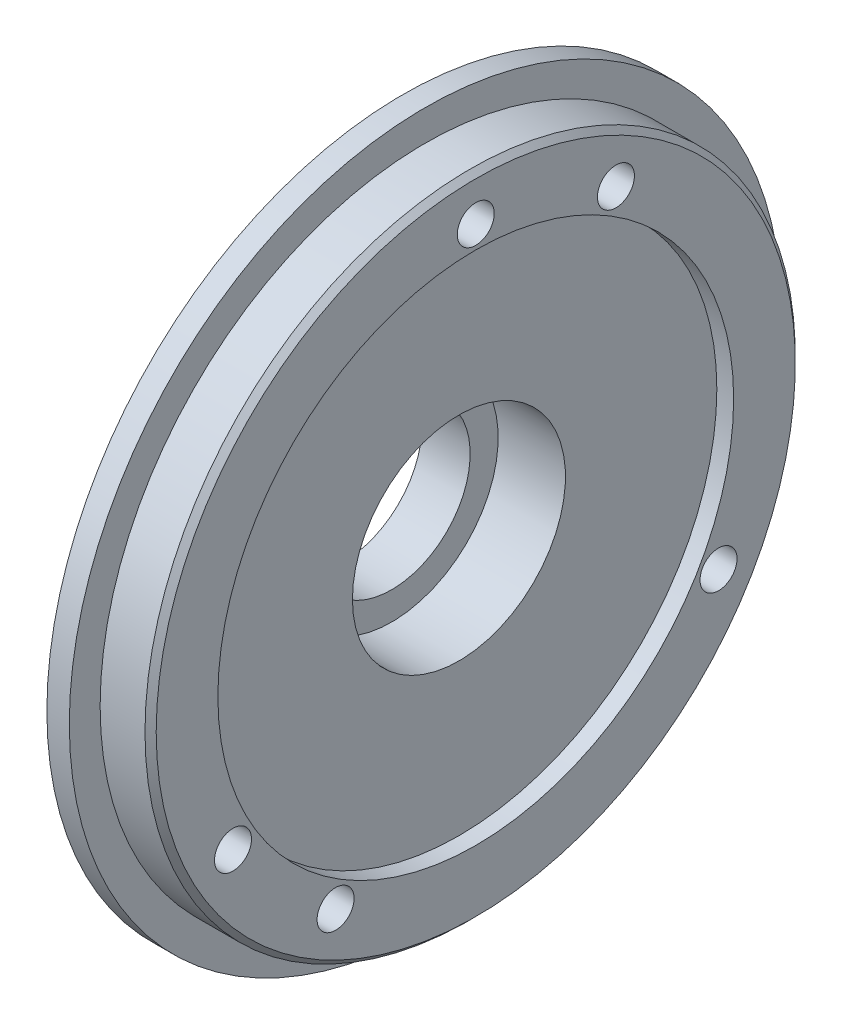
ISO-10303-21;
HEADER;
FILE_DESCRIPTION(('STEP AP214'),'2;1');
FILE_NAME('part.step','',(''),(''),'','','');
FILE_SCHEMA(('AUTOMOTIVE_DESIGN { 1 0 10303 214 1 1 1 1 }'));
ENDSEC;
DATA;
#1=APPLICATION_CONTEXT('core data for automotive mechanical design processes');
#2=APPLICATION_PROTOCOL_DEFINITION('international standard','automotive_design',2000,#1);
#3=PRODUCT_CONTEXT('',#1,'mechanical');
#4=PRODUCT('Part','Part','',(#3));
#5=PRODUCT_RELATED_PRODUCT_CATEGORY('part','',(#4));
#6=PRODUCT_DEFINITION_FORMATION('','',#4);
#7=PRODUCT_DEFINITION_CONTEXT('part definition',#1,'design');
#8=PRODUCT_DEFINITION('design','',#6,#7);
#9=PRODUCT_DEFINITION_SHAPE('','',#8);
#10=(LENGTH_UNIT() NAMED_UNIT(*) SI_UNIT(.MILLI.,.METRE.));
#11=(NAMED_UNIT(*) PLANE_ANGLE_UNIT() SI_UNIT($,.RADIAN.));
#12=(NAMED_UNIT(*) SI_UNIT($,.STERADIAN.) SOLID_ANGLE_UNIT());
#13=UNCERTAINTY_MEASURE_WITH_UNIT(LENGTH_MEASURE(1.E-05),#10,'distance_accuracy_value','');
#14=(GEOMETRIC_REPRESENTATION_CONTEXT(3) GLOBAL_UNCERTAINTY_ASSIGNED_CONTEXT((#13)) GLOBAL_UNIT_ASSIGNED_CONTEXT((#10,
#11,#12)) REPRESENTATION_CONTEXT('',''));
#15=CARTESIAN_POINT('',(0.,0.,0.));
#16=DIRECTION('',(0.,0.,1.));
#17=DIRECTION('',(1.,0.,0.));
#18=AXIS2_PLACEMENT_3D('',#15,#16,#17);
#19=CARTESIAN_POINT('',(-7.3,14.,0.));
#20=DIRECTION('',(1.,0.,0.));
#21=DIRECTION('',(0.,0.,-1.));
#22=AXIS2_PLACEMENT_3D('',#19,#20,#21);
#23=PLANE('',#22);
#24=CARTESIAN_POINT('',(-7.3,-5.49999999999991,-9.52627944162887));
#25=DIRECTION('',(-1.,0.,0.));
#26=DIRECTION('',(0.,0.,1.));
#27=AXIS2_PLACEMENT_3D('',#24,#25,#26);
#28=CIRCLE('',#27,1.025);
#29=CARTESIAN_POINT('',(-7.3,-5.49999999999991,-8.50127944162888));
#30=VERTEX_POINT('',#29);
#31=EDGE_CURVE('E61',#30,#30,#28,.T.);
#32=ORIENTED_EDGE('',*,*,#31,.F.);
#33=EDGE_LOOP('',(#32));
#34=FACE_BOUND('',#33,.T.);
#35=CARTESIAN_POINT('',(-7.3,0.,0.));
#36=DIRECTION('',(1.,0.,0.));
#37=DIRECTION('',(0.,0.,-1.));
#38=AXIS2_PLACEMENT_3D('',#35,#36,#37);
#39=CIRCLE('',#38,13.5);
#40=CARTESIAN_POINT('',(-7.3,0.,-13.5));
#41=VERTEX_POINT('',#40);
#42=EDGE_CURVE('E42',#41,#41,#39,.F.);
#43=ORIENTED_EDGE('',*,*,#42,.T.);
#44=EDGE_LOOP('',(#43));
#45=FACE_BOUND('',#44,.T.);
#46=CARTESIAN_POINT('',(-7.3,0.,0.));
#47=DIRECTION('',(-1.,0.,0.));
#48=DIRECTION('',(0.,0.,1.));
#49=AXIS2_PLACEMENT_3D('',#46,#47,#48);
#50=CIRCLE('',#49,7.);
#51=CARTESIAN_POINT('',(-7.29999999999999,0.,7.));
#52=VERTEX_POINT('',#51);
#53=EDGE_CURVE('E84',#52,#52,#50,.T.);
#54=ORIENTED_EDGE('',*,*,#53,.F.);
#55=EDGE_LOOP('',(#54));
#56=FACE_BOUND('',#55,.T.);
#57=CARTESIAN_POINT('',(-7.3,11.,0.));
#58=DIRECTION('',(-1.,0.,0.));
#59=DIRECTION('',(0.,0.,1.));
#60=AXIS2_PLACEMENT_3D('',#57,#58,#59);
#61=CIRCLE('',#60,1.025);
#62=CARTESIAN_POINT('',(-7.3,11.,1.025));
#63=VERTEX_POINT('',#62);
#64=EDGE_CURVE('E75',#63,#63,#61,.T.);
#65=ORIENTED_EDGE('',*,*,#64,.F.);
#66=EDGE_LOOP('',(#65));
#67=FACE_BOUND('',#66,.T.);
#68=CARTESIAN_POINT('',(-7.3,-5.50000000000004,9.5262794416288));
#69=DIRECTION('',(-1.,0.,0.));
#70=DIRECTION('',(0.,0.,1.));
#71=AXIS2_PLACEMENT_3D('',#68,#69,#70);
#72=CIRCLE('',#71,1.025);
#73=CARTESIAN_POINT('',(-7.3,-5.50000000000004,10.5512794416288));
#74=VERTEX_POINT('',#73);
#75=EDGE_CURVE('E69',#74,#74,#72,.T.);
#76=ORIENTED_EDGE('',*,*,#75,.F.);
#77=EDGE_LOOP('',(#76));
#78=FACE_BOUND('',#77,.T.);
#79=ADVANCED_FACE('F33',(#34,#45,#56,#67,#78),#23,.F.);
#80=CARTESIAN_POINT('',(3.,0.,0.));
#81=DIRECTION('',(-1.,0.,0.));
#82=DIRECTION('',(0.,0.,1.));
#83=AXIS2_PLACEMENT_3D('',#80,#81,#82);
#84=PLANE('',#83);
#85=CARTESIAN_POINT('',(3.,0.,0.));
#86=DIRECTION('',(-1.,0.,0.));
#87=DIRECTION('',(0.,0.,1.));
#88=AXIS2_PLACEMENT_3D('',#85,#86,#87);
#89=CIRCLE('',#88,23.);
#90=CARTESIAN_POINT('',(3.,0.,23.));
#91=VERTEX_POINT('',#90);
#92=EDGE_CURVE('E142',#91,#91,#89,.T.);
#93=ORIENTED_EDGE('',*,*,#92,.F.);
#94=EDGE_LOOP('',(#93));
#95=FACE_BOUND('',#94,.T.);
#96=CARTESIAN_POINT('',(3.,0.,0.));
#97=DIRECTION('',(-1.,0.,0.));
#98=DIRECTION('',(0.,0.,1.));
#99=AXIS2_PLACEMENT_3D('',#96,#97,#98);
#100=CIRCLE('',#99,9.5);
#101=CARTESIAN_POINT('',(3.,0.,9.5));
#102=VERTEX_POINT('',#101);
#103=EDGE_CURVE('E81',#102,#102,#100,.T.);
#104=ORIENTED_EDGE('',*,*,#103,.T.);
#105=EDGE_LOOP('',(#104));
#106=FACE_BOUND('',#105,.T.);
#107=ADVANCED_FACE('F35',(#95,#106),#84,.F.);
#108=CARTESIAN_POINT('',(4.5,0.,0.));
#109=DIRECTION('',(-1.,0.,0.));
#110=DIRECTION('',(0.,0.,1.));
#111=AXIS2_PLACEMENT_3D('',#108,#109,#110);
#112=CYLINDRICAL_SURFACE('',#111,7.);
#113=CARTESIAN_POINT('',(-3.,0.,0.));
#114=DIRECTION('',(1.,0.,0.));
#115=DIRECTION('',(0.,0.,-1.));
#116=AXIS2_PLACEMENT_3D('',#113,#114,#115);
#117=CIRCLE('',#116,7.);
#118=CARTESIAN_POINT('',(-3.,0.,7.));
#119=VERTEX_POINT('',#118);
#120=EDGE_CURVE('E37',#119,#119,#117,.F.);
#121=CARTESIAN_POINT('',(-7.29999999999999,0.,7.));
#122=CARTESIAN_POINT('',(-7.25520833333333,0.,7.));
#123=CARTESIAN_POINT('',(-7.21041666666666,0.,7.));
#124=CARTESIAN_POINT('',(-7.12083333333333,0.,7.));
#125=CARTESIAN_POINT('',(-7.07604166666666,0.,7.));
#126=CARTESIAN_POINT('',(-6.98645833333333,0.,7.));
#127=CARTESIAN_POINT('',(-6.94166666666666,0.,7.));
#128=CARTESIAN_POINT('',(-6.85208333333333,0.,7.));
#129=CARTESIAN_POINT('',(-6.80729166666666,0.,7.));
#130=CARTESIAN_POINT('',(-6.71770833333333,0.,7.));
#131=CARTESIAN_POINT('',(-6.67291666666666,0.,7.));
#132=CARTESIAN_POINT('',(-6.58333333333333,0.,7.));
#133=CARTESIAN_POINT('',(-6.53854166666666,0.,7.));
#134=CARTESIAN_POINT('',(-6.44895833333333,0.,7.));
#135=CARTESIAN_POINT('',(-6.40416666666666,0.,7.));
#136=CARTESIAN_POINT('',(-6.31458333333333,0.,7.));
#137=CARTESIAN_POINT('',(-6.26979166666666,0.,7.));
#138=CARTESIAN_POINT('',(-6.18020833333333,0.,7.));
#139=CARTESIAN_POINT('',(-6.13541666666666,0.,7.));
#140=CARTESIAN_POINT('',(-6.04583333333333,0.,7.));
#141=CARTESIAN_POINT('',(-6.00104166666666,0.,7.));
#142=CARTESIAN_POINT('',(-5.91145833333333,0.,7.));
#143=CARTESIAN_POINT('',(-5.86666666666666,0.,7.));
#144=CARTESIAN_POINT('',(-5.77708333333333,0.,7.));
#145=CARTESIAN_POINT('',(-5.73229166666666,0.,7.));
#146=CARTESIAN_POINT('',(-5.64270833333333,0.,7.));
#147=CARTESIAN_POINT('',(-5.59791666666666,0.,7.));
#148=CARTESIAN_POINT('',(-5.50833333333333,0.,7.));
#149=CARTESIAN_POINT('',(-5.46354166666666,0.,7.));
#150=CARTESIAN_POINT('',(-5.37395833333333,0.,7.));
#151=CARTESIAN_POINT('',(-5.32916666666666,0.,7.));
#152=CARTESIAN_POINT('',(-5.23958333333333,0.,7.));
#153=CARTESIAN_POINT('',(-5.19479166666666,0.,7.));
#154=CARTESIAN_POINT('',(-5.10520833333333,0.,7.));
#155=CARTESIAN_POINT('',(-5.06041666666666,0.,7.));
#156=CARTESIAN_POINT('',(-4.97083333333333,0.,7.));
#157=CARTESIAN_POINT('',(-4.92604166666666,0.,7.));
#158=CARTESIAN_POINT('',(-4.83645833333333,0.,7.));
#159=CARTESIAN_POINT('',(-4.79166666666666,0.,7.));
#160=CARTESIAN_POINT('',(-4.70208333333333,0.,7.));
#161=CARTESIAN_POINT('',(-4.65729166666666,0.,7.));
#162=CARTESIAN_POINT('',(-4.56770833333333,0.,7.));
#163=CARTESIAN_POINT('',(-4.52291666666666,0.,7.));
#164=CARTESIAN_POINT('',(-4.43333333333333,0.,7.));
#165=CARTESIAN_POINT('',(-4.38854166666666,0.,7.));
#166=CARTESIAN_POINT('',(-4.29895833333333,0.,7.));
#167=CARTESIAN_POINT('',(-4.25416666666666,0.,7.));
#168=CARTESIAN_POINT('',(-4.16458333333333,0.,7.));
#169=CARTESIAN_POINT('',(-4.11979166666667,0.,7.));
#170=CARTESIAN_POINT('',(-4.03020833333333,0.,7.));
#171=CARTESIAN_POINT('',(-3.98541666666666,0.,7.));
#172=CARTESIAN_POINT('',(-3.89583333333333,0.,7.));
#173=CARTESIAN_POINT('',(-3.85104166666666,0.,7.));
#174=CARTESIAN_POINT('',(-3.76145833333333,0.,7.));
#175=CARTESIAN_POINT('',(-3.71666666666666,0.,7.));
#176=CARTESIAN_POINT('',(-3.62708333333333,0.,7.));
#177=CARTESIAN_POINT('',(-3.58229166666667,0.,7.));
#178=CARTESIAN_POINT('',(-3.49270833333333,0.,7.));
#179=CARTESIAN_POINT('',(-3.44791666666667,0.,7.));
#180=CARTESIAN_POINT('',(-3.35833333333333,0.,7.));
#181=CARTESIAN_POINT('',(-3.31354166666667,0.,7.));
#182=CARTESIAN_POINT('',(-3.22395833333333,0.,7.));
#183=CARTESIAN_POINT('',(-3.17916666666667,0.,7.));
#184=CARTESIAN_POINT('',(-3.08958333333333,0.,7.));
#185=CARTESIAN_POINT('',(-3.04479166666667,0.,7.));
#186=CARTESIAN_POINT('',(-3.,0.,7.));
#187=B_SPLINE_CURVE_WITH_KNOTS('',3,(#121,#122,#123,#124,#125,#126,#127,#128,#129,#130,#131,
#132,#133,#134,#135,#136,#137,#138,#139,#140,#141,#142,#143,#144,#145,#146,#147,#148,#149,#150,
#151,#152,#153,#154,#155,#156,#157,#158,#159,#160,#161,#162,#163,#164,#165,#166,#167,#168,#169,
#170,#171,#172,#173,#174,#175,#176,#177,#178,#179,#180,#181,#182,#183,#184,#185,#186),
.UNSPECIFIED.,.F.,.F.,(4,2,2,2,2,2,2,2,2,2,2,2,2,2,2,2,2,2,2,2,2,2,2,2,2,2,2,2,2,2,2,2,4),(0.,
0.134374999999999,0.26875,0.403124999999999,0.5375,0.671874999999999,0.80625,0.940624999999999,
1.075,1.209375,1.34375,1.478125,1.6125,1.746875,1.88125,2.015625,2.15,2.284375,2.41875,2.553125,
2.6875,2.821875,2.95625,3.090625,3.225,3.359375,3.49375,3.628125,3.76249999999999,3.896875,
4.03124999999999,4.16562499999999,4.29999999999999),.UNSPECIFIED.);
#188=EDGE_CURVE('BSEAM182',#52,#119,#187,.T.);
#189=ORIENTED_EDGE('',*,*,#53,.T.);
#190=ORIENTED_EDGE('',*,*,#120,.F.);
#191=ORIENTED_EDGE('',*,*,#188,.T.);
#192=ORIENTED_EDGE('',*,*,#188,.F.);
#193=EDGE_LOOP('',(#189,#191,#190,#192));
#194=FACE_BOUND('',#193,.T.);
#195=ADVANCED_FACE('F182',(#194),#112,.F.);
#196=CARTESIAN_POINT('',(-3.5,29.,0.));
#197=DIRECTION('',(1.,0.,0.));
#198=DIRECTION('',(0.,0.,-1.));
#199=AXIS2_PLACEMENT_3D('',#196,#197,#198);
#200=PLANE('',#199);
#201=CARTESIAN_POINT('',(-3.5,21.650635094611,-12.5));
#202=DIRECTION('',(-1.,0.,0.));
#203=DIRECTION('',(0.,0.,1.));
#204=AXIS2_PLACEMENT_3D('',#201,#202,#203);
#205=CIRCLE('',#204,1.64999999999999);
#206=CARTESIAN_POINT('',(-3.5,21.650635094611,-10.85));
#207=VERTEX_POINT('',#206);
#208=EDGE_CURVE('E96',#207,#207,#205,.T.);
#209=ORIENTED_EDGE('',*,*,#208,.F.);
#210=EDGE_LOOP('',(#209));
#211=FACE_BOUND('',#210,.T.);
#212=CARTESIAN_POINT('',(-3.5,-12.4999999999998,-21.6506350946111));
#213=DIRECTION('',(-1.,0.,0.));
#214=DIRECTION('',(0.,0.,1.));
#215=AXIS2_PLACEMENT_3D('',#212,#213,#214);
#216=CIRCLE('',#215,1.65);
#217=CARTESIAN_POINT('',(-3.5,-12.4999999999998,-20.0006350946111));
#218=VERTEX_POINT('',#217);
#219=EDGE_CURVE('E99',#218,#218,#216,.T.);
#220=ORIENTED_EDGE('',*,*,#219,.F.);
#221=EDGE_LOOP('',(#220));
#222=FACE_BOUND('',#221,.T.);
#223=CARTESIAN_POINT('',(-3.5,0.,0.));
#224=DIRECTION('',(-1.,0.,0.));
#225=DIRECTION('',(0.,0.,1.));
#226=AXIS2_PLACEMENT_3D('',#223,#224,#225);
#227=CIRCLE('',#226,29.);
#228=CARTESIAN_POINT('',(-3.5,0.,29.));
#229=VERTEX_POINT('',#228);
#230=EDGE_CURVE('E124',#229,#229,#227,.T.);
#231=ORIENTED_EDGE('',*,*,#230,.T.);
#232=EDGE_LOOP('',(#231));
#233=FACE_BOUND('',#232,.T.);
#234=CARTESIAN_POINT('',(-3.5,0.,0.));
#235=DIRECTION('',(-1.,0.,0.));
#236=DIRECTION('',(0.,0.,1.));
#237=AXIS2_PLACEMENT_3D('',#234,#235,#236);
#238=CIRCLE('',#237,20.5);
#239=CARTESIAN_POINT('',(-3.5,0.,20.5));
#240=VERTEX_POINT('',#239);
#241=EDGE_CURVE('E121',#240,#240,#238,.T.);
#242=ORIENTED_EDGE('',*,*,#241,.F.);
#243=EDGE_LOOP('',(#242));
#244=FACE_BOUND('',#243,.T.);
#245=CARTESIAN_POINT('',(-3.5,25.,0.));
#246=DIRECTION('',(-1.,0.,0.));
#247=DIRECTION('',(0.,0.,1.));
#248=AXIS2_PLACEMENT_3D('',#245,#246,#247);
#249=CIRCLE('',#248,1.65);
#250=CARTESIAN_POINT('',(-3.5,25.,1.65));
#251=VERTEX_POINT('',#250);
#252=EDGE_CURVE('E109',#251,#251,#249,.T.);
#253=ORIENTED_EDGE('',*,*,#252,.F.);
#254=EDGE_LOOP('',(#253));
#255=FACE_BOUND('',#254,.T.);
#256=CARTESIAN_POINT('',(-3.5,-12.5000000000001,21.6506350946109));
#257=DIRECTION('',(-1.,0.,0.));
#258=DIRECTION('',(0.,0.,1.));
#259=AXIS2_PLACEMENT_3D('',#256,#257,#258);
#260=CIRCLE('',#259,1.65);
#261=CARTESIAN_POINT('',(-3.5,-12.5000000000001,23.3006350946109));
#262=VERTEX_POINT('',#261);
#263=EDGE_CURVE('E103',#262,#262,#260,.T.);
#264=ORIENTED_EDGE('',*,*,#263,.F.);
#265=EDGE_LOOP('',(#264));
#266=FACE_BOUND('',#265,.T.);
#267=CARTESIAN_POINT('',(-3.5,-21.650635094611,12.4999999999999));
#268=DIRECTION('',(-1.,0.,0.));
#269=DIRECTION('',(0.,0.,1.));
#270=AXIS2_PLACEMENT_3D('',#267,#268,#269);
#271=CIRCLE('',#270,1.64999999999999);
#272=CARTESIAN_POINT('',(-3.5,-21.650635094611,14.1499999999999));
#273=VERTEX_POINT('',#272);
#274=EDGE_CURVE('E90',#273,#273,#271,.T.);
#275=ORIENTED_EDGE('',*,*,#274,.F.);
#276=EDGE_LOOP('',(#275));
#277=FACE_BOUND('',#276,.T.);
#278=ADVANCED_FACE('F202',(#211,#222,#233,#244,#255,#266,#277),#200,.F.);
#279=CARTESIAN_POINT('',(0.,0.,0.));
#280=DIRECTION('',(-1.,0.,0.));
#281=DIRECTION('',(0.,0.,1.));
#282=AXIS2_PLACEMENT_3D('',#279,#280,#281);
#283=CYLINDRICAL_SURFACE('',#282,23.);
#284=CARTESIAN_POINT('',(4.5,0.,0.));
#285=DIRECTION('',(-1.,0.,0.));
#286=DIRECTION('',(0.,0.,1.));
#287=AXIS2_PLACEMENT_3D('',#284,#285,#286);
#288=CIRCLE('',#287,23.);
#289=CARTESIAN_POINT('',(4.5,0.,23.));
#290=VERTEX_POINT('',#289);
#291=EDGE_CURVE('E139',#290,#290,#288,.T.);
#292=ORIENTED_EDGE('',*,*,#291,.F.);
#293=EDGE_LOOP('',(#292));
#294=FACE_BOUND('',#293,.T.);
#295=ORIENTED_EDGE('',*,*,#92,.T.);
#296=EDGE_LOOP('',(#295));
#297=FACE_BOUND('',#296,.T.);
#298=ADVANCED_FACE('F205',(#294,#297),#283,.F.);
#299=CARTESIAN_POINT('',(4.5,23.,0.));
#300=DIRECTION('',(-1.,0.,0.));
#301=DIRECTION('',(0.,0.,1.));
#302=AXIS2_PLACEMENT_3D('',#299,#300,#301);
#303=PLANE('',#302);
#304=CARTESIAN_POINT('',(4.5,0.,0.));
#305=DIRECTION('',(-1.,0.,0.));
#306=DIRECTION('',(0.,0.,1.));
#307=AXIS2_PLACEMENT_3D('',#304,#305,#306);
#308=CIRCLE('',#307,28.5);
#309=CARTESIAN_POINT('',(4.5,0.,28.5));
#310=VERTEX_POINT('',#309);
#311=EDGE_CURVE('E150',#310,#310,#308,.F.);
#312=ORIENTED_EDGE('',*,*,#311,.T.);
#313=EDGE_LOOP('',(#312));
#314=FACE_BOUND('',#313,.T.);
#315=CARTESIAN_POINT('',(4.5,-21.650635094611,12.4999999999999));
#316=DIRECTION('',(-1.,0.,0.));
#317=DIRECTION('',(0.,0.,1.));
#318=AXIS2_PLACEMENT_3D('',#315,#316,#317);
#319=CIRCLE('',#318,1.65);
#320=CARTESIAN_POINT('',(4.5,-21.650635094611,14.1499999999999));
#321=VERTEX_POINT('',#320);
#322=EDGE_CURVE('E87',#321,#321,#319,.T.);
#323=ORIENTED_EDGE('',*,*,#322,.T.);
#324=EDGE_LOOP('',(#323));
#325=FACE_BOUND('',#324,.T.);
#326=CARTESIAN_POINT('',(4.5,21.650635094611,-12.5));
#327=DIRECTION('',(-1.,0.,0.));
#328=DIRECTION('',(0.,0.,1.));
#329=AXIS2_PLACEMENT_3D('',#326,#327,#328);
#330=CIRCLE('',#329,1.65);
#331=CARTESIAN_POINT('',(4.5,21.650635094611,-10.85));
#332=VERTEX_POINT('',#331);
#333=EDGE_CURVE('E93',#332,#332,#330,.T.);
#334=ORIENTED_EDGE('',*,*,#333,.T.);
#335=EDGE_LOOP('',(#334));
#336=FACE_BOUND('',#335,.T.);
#337=CARTESIAN_POINT('',(4.5,-12.4999999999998,-21.6506350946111));
#338=DIRECTION('',(-1.,0.,0.));
#339=DIRECTION('',(0.,0.,1.));
#340=AXIS2_PLACEMENT_3D('',#337,#338,#339);
#341=CIRCLE('',#340,1.65);
#342=CARTESIAN_POINT('',(4.5,-12.4999999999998,-20.0006350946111));
#343=VERTEX_POINT('',#342);
#344=EDGE_CURVE('E102',#343,#343,#341,.T.);
#345=ORIENTED_EDGE('',*,*,#344,.T.);
#346=EDGE_LOOP('',(#345));
#347=FACE_BOUND('',#346,.T.);
#348=CARTESIAN_POINT('',(4.5,-12.5000000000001,21.6506350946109));
#349=DIRECTION('',(-1.,0.,0.));
#350=DIRECTION('',(0.,0.,1.));
#351=AXIS2_PLACEMENT_3D('',#348,#349,#350);
#352=CIRCLE('',#351,1.65);
#353=CARTESIAN_POINT('',(4.5,-12.5000000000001,23.3006350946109));
#354=VERTEX_POINT('',#353);
#355=EDGE_CURVE('E106',#354,#354,#352,.T.);
#356=ORIENTED_EDGE('',*,*,#355,.T.);
#357=EDGE_LOOP('',(#356));
#358=FACE_BOUND('',#357,.T.);
#359=CARTESIAN_POINT('',(4.5,25.,0.));
#360=DIRECTION('',(-1.,0.,0.));
#361=DIRECTION('',(0.,0.,1.));
#362=AXIS2_PLACEMENT_3D('',#359,#360,#361);
#363=CIRCLE('',#362,1.65);
#364=CARTESIAN_POINT('',(4.5,25.,1.65));
#365=VERTEX_POINT('',#364);
#366=EDGE_CURVE('E112',#365,#365,#363,.T.);
#367=ORIENTED_EDGE('',*,*,#366,.T.);
#368=EDGE_LOOP('',(#367));
#369=FACE_BOUND('',#368,.T.);
#370=ORIENTED_EDGE('',*,*,#291,.T.);
#371=EDGE_LOOP('',(#370));
#372=FACE_BOUND('',#371,.T.);
#373=ADVANCED_FACE('F225',(#314,#325,#336,#347,#358,#369,#372),#303,.F.);
#374=CARTESIAN_POINT('',(0.,0.,0.));
#375=DIRECTION('',(-1.,0.,0.));
#376=DIRECTION('',(0.,0.,1.));
#377=AXIS2_PLACEMENT_3D('',#374,#375,#376);
#378=CYLINDRICAL_SURFACE('',#377,29.);
#379=CARTESIAN_POINT('',(4.,0.,0.));
#380=DIRECTION('',(-1.,0.,0.));
#381=DIRECTION('',(0.,0.,1.));
#382=AXIS2_PLACEMENT_3D('',#379,#380,#381);
#383=CIRCLE('',#382,29.);
#384=CARTESIAN_POINT('',(4.,0.,29.));
#385=VERTEX_POINT('',#384);
#386=EDGE_CURVE('E145',#385,#385,#383,.T.);
#387=ORIENTED_EDGE('',*,*,#386,.T.);
#388=EDGE_LOOP('',(#387));
#389=FACE_BOUND('',#388,.T.);
#390=CARTESIAN_POINT('',(0.,0.,0.));
#391=DIRECTION('',(-1.,0.,0.));
#392=DIRECTION('',(0.,0.,1.));
#393=AXIS2_PLACEMENT_3D('',#390,#391,#392);
#394=CIRCLE('',#393,29.);
#395=CARTESIAN_POINT('',(0.,0.,29.));
#396=VERTEX_POINT('',#395);
#397=EDGE_CURVE('E136',#396,#396,#394,.T.);
#398=ORIENTED_EDGE('',*,*,#397,.F.);
#399=EDGE_LOOP('',(#398));
#400=FACE_BOUND('',#399,.T.);
#401=ADVANCED_FACE('F221',(#389,#400),#378,.T.);
#402=CARTESIAN_POINT('',(0.,29.,0.));
#403=DIRECTION('',(-1.,0.,0.));
#404=DIRECTION('',(0.,0.,1.));
#405=AXIS2_PLACEMENT_3D('',#402,#403,#404);
#406=PLANE('',#405);
#407=CARTESIAN_POINT('',(0.,0.,0.));
#408=DIRECTION('',(-1.,0.,0.));
#409=DIRECTION('',(0.,0.,1.));
#410=AXIS2_PLACEMENT_3D('',#407,#408,#409);
#411=CIRCLE('',#410,31.75);
#412=CARTESIAN_POINT('',(0.,0.,31.75));
#413=VERTEX_POINT('',#412);
#414=EDGE_CURVE('E133',#413,#413,#411,.T.);
#415=ORIENTED_EDGE('',*,*,#414,.F.);
#416=EDGE_LOOP('',(#415));
#417=FACE_BOUND('',#416,.T.);
#418=ORIENTED_EDGE('',*,*,#397,.T.);
#419=EDGE_LOOP('',(#418));
#420=FACE_BOUND('',#419,.T.);
#421=ADVANCED_FACE('F217',(#417,#420),#406,.F.);
#422=CARTESIAN_POINT('',(0.,0.,0.));
#423=DIRECTION('',(-1.,0.,0.));
#424=DIRECTION('',(0.,0.,1.));
#425=AXIS2_PLACEMENT_3D('',#422,#423,#424);
#426=CYLINDRICAL_SURFACE('',#425,31.75);
#427=CARTESIAN_POINT('',(-2.,0.,0.));
#428=DIRECTION('',(-1.,0.,0.));
#429=DIRECTION('',(0.,0.,1.));
#430=AXIS2_PLACEMENT_3D('',#427,#428,#429);
#431=CIRCLE('',#430,31.75);
#432=CARTESIAN_POINT('',(-2.,0.,31.75));
#433=VERTEX_POINT('',#432);
#434=EDGE_CURVE('E130',#433,#433,#431,.T.);
#435=ORIENTED_EDGE('',*,*,#434,.F.);
#436=EDGE_LOOP('',(#435));
#437=FACE_BOUND('',#436,.T.);
#438=ORIENTED_EDGE('',*,*,#414,.T.);
#439=EDGE_LOOP('',(#438));
#440=FACE_BOUND('',#439,.T.);
#441=ADVANCED_FACE('F213',(#437,#440),#426,.T.);
#442=CARTESIAN_POINT('',(-2.,31.75,0.));
#443=DIRECTION('',(1.,0.,0.));
#444=DIRECTION('',(0.,0.,-1.));
#445=AXIS2_PLACEMENT_3D('',#442,#443,#444);
#446=PLANE('',#445);
#447=CARTESIAN_POINT('',(-2.,0.,0.));
#448=DIRECTION('',(-1.,0.,0.));
#449=DIRECTION('',(0.,0.,1.));
#450=AXIS2_PLACEMENT_3D('',#447,#448,#449);
#451=CIRCLE('',#450,29.);
#452=CARTESIAN_POINT('',(-2.,0.,29.));
#453=VERTEX_POINT('',#452);
#454=EDGE_CURVE('E127',#453,#453,#451,.T.);
#455=ORIENTED_EDGE('',*,*,#454,.F.);
#456=EDGE_LOOP('',(#455));
#457=FACE_BOUND('',#456,.T.);
#458=ORIENTED_EDGE('',*,*,#434,.T.);
#459=EDGE_LOOP('',(#458));
#460=FACE_BOUND('',#459,.T.);
#461=ADVANCED_FACE('F209',(#457,#460),#446,.F.);
#462=CARTESIAN_POINT('',(0.,0.,0.));
#463=DIRECTION('',(-1.,0.,0.));
#464=DIRECTION('',(0.,0.,1.));
#465=AXIS2_PLACEMENT_3D('',#462,#463,#464);
#466=CYLINDRICAL_SURFACE('',#465,29.);
#467=ORIENTED_EDGE('',*,*,#230,.F.);
#468=EDGE_LOOP('',(#467));
#469=FACE_BOUND('',#468,.T.);
#470=ORIENTED_EDGE('',*,*,#454,.T.);
#471=EDGE_LOOP('',(#470));
#472=FACE_BOUND('',#471,.T.);
#473=ADVANCED_FACE('F200',(#469,#472),#466,.T.);
#474=CARTESIAN_POINT('',(0.,0.,0.));
#475=DIRECTION('',(-1.,0.,0.));
#476=DIRECTION('',(0.,0.,1.));
#477=AXIS2_PLACEMENT_3D('',#474,#475,#476);
#478=CYLINDRICAL_SURFACE('',#477,20.5);
#479=CARTESIAN_POINT('',(-2.,0.,0.));
#480=DIRECTION('',(-1.,0.,0.));
#481=DIRECTION('',(0.,0.,1.));
#482=AXIS2_PLACEMENT_3D('',#479,#480,#481);
#483=CIRCLE('',#482,20.5);
#484=CARTESIAN_POINT('',(-2.,0.,20.5));
#485=VERTEX_POINT('',#484);
#486=EDGE_CURVE('E118',#485,#485,#483,.T.);
#487=ORIENTED_EDGE('',*,*,#486,.F.);
#488=EDGE_LOOP('',(#487));
#489=FACE_BOUND('',#488,.T.);
#490=ORIENTED_EDGE('',*,*,#241,.T.);
#491=EDGE_LOOP('',(#490));
#492=FACE_BOUND('',#491,.T.);
#493=ADVANCED_FACE('F196',(#489,#492),#478,.F.);
#494=CARTESIAN_POINT('',(-2.,20.5,0.));
#495=DIRECTION('',(1.,0.,0.));
#496=DIRECTION('',(0.,0.,-1.));
#497=AXIS2_PLACEMENT_3D('',#494,#495,#496);
#498=PLANE('',#497);
#499=CARTESIAN_POINT('',(-2.,0.,0.));
#500=DIRECTION('',(-1.,0.,0.));
#501=DIRECTION('',(0.,0.,1.));
#502=AXIS2_PLACEMENT_3D('',#499,#500,#501);
#503=CIRCLE('',#502,14.);
#504=CARTESIAN_POINT('',(-2.,0.,14.));
#505=VERTEX_POINT('',#504);
#506=EDGE_CURVE('E115',#505,#505,#503,.T.);
#507=ORIENTED_EDGE('',*,*,#506,.F.);
#508=EDGE_LOOP('',(#507));
#509=FACE_BOUND('',#508,.T.);
#510=ORIENTED_EDGE('',*,*,#486,.T.);
#511=EDGE_LOOP('',(#510));
#512=FACE_BOUND('',#511,.T.);
#513=ADVANCED_FACE('F192',(#509,#512),#498,.F.);
#514=CARTESIAN_POINT('',(0.,0.,0.));
#515=DIRECTION('',(-1.,0.,0.));
#516=DIRECTION('',(0.,0.,1.));
#517=AXIS2_PLACEMENT_3D('',#514,#515,#516);
#518=CYLINDRICAL_SURFACE('',#517,14.);
#519=CARTESIAN_POINT('',(-6.79999999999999,0.,0.));
#520=DIRECTION('',(1.,0.,0.));
#521=DIRECTION('',(0.,0.,-1.));
#522=AXIS2_PLACEMENT_3D('',#519,#520,#521);
#523=CIRCLE('',#522,14.);
#524=CARTESIAN_POINT('',(-6.79999999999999,0.,-14.));
#525=VERTEX_POINT('',#524);
#526=EDGE_CURVE('E11',#525,#525,#523,.T.);
#527=ORIENTED_EDGE('',*,*,#526,.T.);
#528=EDGE_LOOP('',(#527));
#529=FACE_BOUND('',#528,.T.);
#530=ORIENTED_EDGE('',*,*,#506,.T.);
#531=EDGE_LOOP('',(#530));
#532=FACE_BOUND('',#531,.T.);
#533=ADVANCED_FACE('F189',(#529,#532),#518,.T.);
#534=CARTESIAN_POINT('',(-3.5,25.,0.));
#535=DIRECTION('',(-1.,0.,0.));
#536=DIRECTION('',(0.,0.,1.));
#537=AXIS2_PLACEMENT_3D('',#534,#535,#536);
#538=CYLINDRICAL_SURFACE('',#537,1.65);
#539=ORIENTED_EDGE('',*,*,#252,.T.);
#540=EDGE_LOOP('',(#539));
#541=FACE_BOUND('',#540,.T.);
#542=ORIENTED_EDGE('',*,*,#366,.F.);
#543=EDGE_LOOP('',(#542));
#544=FACE_BOUND('',#543,.T.);
#545=ADVANCED_FACE('F187',(#541,#544),#538,.F.);
#546=CARTESIAN_POINT('',(-3.5,-12.5000000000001,21.6506350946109));
#547=DIRECTION('',(-1.,0.,0.));
#548=DIRECTION('',(0.,0.,1.));
#549=AXIS2_PLACEMENT_3D('',#546,#547,#548);
#550=CYLINDRICAL_SURFACE('',#549,1.65);
#551=ORIENTED_EDGE('',*,*,#263,.T.);
#552=EDGE_LOOP('',(#551));
#553=FACE_BOUND('',#552,.T.);
#554=ORIENTED_EDGE('',*,*,#355,.F.);
#555=EDGE_LOOP('',(#554));
#556=FACE_BOUND('',#555,.T.);
#557=ADVANCED_FACE('F375',(#553,#556),#550,.F.);
#558=CARTESIAN_POINT('',(-3.5,-12.4999999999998,-21.6506350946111));
#559=DIRECTION('',(-1.,0.,0.));
#560=DIRECTION('',(0.,0.,1.));
#561=AXIS2_PLACEMENT_3D('',#558,#559,#560);
#562=CYLINDRICAL_SURFACE('',#561,1.65);
#563=ORIENTED_EDGE('',*,*,#219,.T.);
#564=EDGE_LOOP('',(#563));
#565=FACE_BOUND('',#564,.T.);
#566=ORIENTED_EDGE('',*,*,#344,.F.);
#567=EDGE_LOOP('',(#566));
#568=FACE_BOUND('',#567,.T.);
#569=ADVANCED_FACE('F366',(#565,#568),#562,.F.);
#570=CARTESIAN_POINT('',(-3.5,21.650635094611,-12.5));
#571=DIRECTION('',(-1.,0.,0.));
#572=DIRECTION('',(0.,0.,1.));
#573=AXIS2_PLACEMENT_3D('',#570,#571,#572);
#574=CYLINDRICAL_SURFACE('',#573,1.64999999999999);
#575=ORIENTED_EDGE('',*,*,#333,.F.);
#576=EDGE_LOOP('',(#575));
#577=FACE_BOUND('',#576,.T.);
#578=ORIENTED_EDGE('',*,*,#208,.T.);
#579=EDGE_LOOP('',(#578));
#580=FACE_BOUND('',#579,.T.);
#581=ADVANCED_FACE('F351',(#577,#580),#574,.F.);
#582=CARTESIAN_POINT('',(-3.5,-21.650635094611,12.4999999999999));
#583=DIRECTION('',(-1.,0.,0.));
#584=DIRECTION('',(0.,0.,1.));
#585=AXIS2_PLACEMENT_3D('',#582,#583,#584);
#586=CYLINDRICAL_SURFACE('',#585,1.64999999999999);
#587=ORIENTED_EDGE('',*,*,#322,.F.);
#588=EDGE_LOOP('',(#587));
#589=FACE_BOUND('',#588,.T.);
#590=ORIENTED_EDGE('',*,*,#274,.T.);
#591=EDGE_LOOP('',(#590));
#592=FACE_BOUND('',#591,.T.);
#593=ADVANCED_FACE('F171',(#589,#592),#586,.F.);
#594=CARTESIAN_POINT('',(4.,0.,0.));
#595=DIRECTION('',(-1.,0.,0.));
#596=DIRECTION('',(0.,0.,1.));
#597=AXIS2_PLACEMENT_3D('',#594,#595,#596);
#598=CONICAL_SURFACE('',#597,29.,0.78539816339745);
#599=ORIENTED_EDGE('',*,*,#311,.F.);
#600=EDGE_LOOP('',(#599));
#601=FACE_BOUND('',#600,.T.);
#602=ORIENTED_EDGE('',*,*,#386,.F.);
#603=EDGE_LOOP('',(#602));
#604=FACE_BOUND('',#603,.T.);
#605=ADVANCED_FACE('F161',(#601,#604),#598,.T.);
#606=CARTESIAN_POINT('',(-7.3,0.,0.));
#607=DIRECTION('',(1.,0.,0.));
#608=DIRECTION('',(0.,0.,-1.));
#609=AXIS2_PLACEMENT_3D('',#606,#607,#608);
#610=CONICAL_SURFACE('',#609,13.5,0.785398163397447);
#611=ORIENTED_EDGE('',*,*,#526,.F.);
#612=EDGE_LOOP('',(#611));
#613=FACE_BOUND('',#612,.T.);
#614=ORIENTED_EDGE('',*,*,#42,.F.);
#615=EDGE_LOOP('',(#614));
#616=FACE_BOUND('',#615,.T.);
#617=ADVANCED_FACE('F158',(#613,#616),#610,.T.);
#618=CARTESIAN_POINT('',(-3.,0.,0.));
#619=DIRECTION('',(1.,0.,0.));
#620=DIRECTION('',(0.,0.,-1.));
#621=AXIS2_PLACEMENT_3D('',#618,#619,#620);
#622=PLANE('',#621);
#623=CARTESIAN_POINT('',(-3.,0.,0.));
#624=DIRECTION('',(-1.,0.,0.));
#625=DIRECTION('',(0.,0.,1.));
#626=AXIS2_PLACEMENT_3D('',#623,#624,#625);
#627=CIRCLE('',#626,9.5);
#628=CARTESIAN_POINT('',(-3.,0.,9.5));
#629=VERTEX_POINT('',#628);
#630=EDGE_CURVE('E78',#629,#629,#627,.T.);
#631=ORIENTED_EDGE('',*,*,#630,.F.);
#632=EDGE_LOOP('',(#631));
#633=FACE_BOUND('',#632,.T.);
#634=ORIENTED_EDGE('',*,*,#120,.T.);
#635=EDGE_LOOP('',(#634));
#636=FACE_BOUND('',#635,.T.);
#637=ADVANCED_FACE('F160',(#633,#636),#622,.T.);
#638=CARTESIAN_POINT('',(0.,0.,0.));
#639=DIRECTION('',(-1.,0.,0.));
#640=DIRECTION('',(0.,0.,1.));
#641=AXIS2_PLACEMENT_3D('',#638,#639,#640);
#642=CYLINDRICAL_SURFACE('',#641,9.5);
#643=ORIENTED_EDGE('',*,*,#630,.T.);
#644=EDGE_LOOP('',(#643));
#645=FACE_BOUND('',#644,.T.);
#646=ORIENTED_EDGE('',*,*,#103,.F.);
#647=EDGE_LOOP('',(#646));
#648=FACE_BOUND('',#647,.T.);
#649=ADVANCED_FACE('F168',(#645,#648),#642,.F.);
#650=CARTESIAN_POINT('',(-7.3,11.,0.));
#651=DIRECTION('',(-1.,0.,0.));
#652=DIRECTION('',(0.,0.,1.));
#653=AXIS2_PLACEMENT_3D('',#650,#651,#652);
#654=CYLINDRICAL_SURFACE('',#653,1.025);
#655=CARTESIAN_POINT('',(0.950000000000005,11.,0.));
#656=DIRECTION('',(-1.,0.,0.));
#657=DIRECTION('',(0.,0.,1.));
#658=AXIS2_PLACEMENT_3D('',#655,#656,#657);
#659=CIRCLE('',#658,1.025);
#660=CARTESIAN_POINT('',(0.950000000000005,11.,1.025));
#661=VERTEX_POINT('',#660);
#662=EDGE_CURVE('E72',#661,#661,#659,.T.);
#663=ORIENTED_EDGE('',*,*,#662,.F.);
#664=EDGE_LOOP('',(#663));
#665=FACE_BOUND('',#664,.T.);
#666=ORIENTED_EDGE('',*,*,#64,.T.);
#667=EDGE_LOOP('',(#666));
#668=FACE_BOUND('',#667,.T.);
#669=ADVANCED_FACE('F240',(#665,#668),#654,.F.);
#670=CARTESIAN_POINT('',(0.950000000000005,11.,0.));
#671=DIRECTION('',(-1.,0.,0.));
#672=DIRECTION('',(0.,0.,1.));
#673=AXIS2_PLACEMENT_3D('',#670,#671,#672);
#674=CONICAL_SURFACE('',#673,1.025,1.0471975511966);
#675=CARTESIAN_POINT('',(1.54178402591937,11.,0.));
#676=VERTEX_POINT('',#675);
#677=VERTEX_LOOP('',#676);
#678=FACE_BOUND('',#677,.T.);
#679=ORIENTED_EDGE('',*,*,#662,.T.);
#680=EDGE_LOOP('',(#679));
#681=FACE_BOUND('',#680,.T.);
#682=ADVANCED_FACE('F246',(#678,#681),#674,.F.);
#683=CARTESIAN_POINT('',(-7.3,-5.50000000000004,9.5262794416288));
#684=DIRECTION('',(-1.,0.,0.));
#685=DIRECTION('',(0.,0.,1.));
#686=AXIS2_PLACEMENT_3D('',#683,#684,#685);
#687=CYLINDRICAL_SURFACE('',#686,1.025);
#688=CARTESIAN_POINT('',(0.950000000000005,-5.50000000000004,9.5262794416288));
#689=DIRECTION('',(-1.,0.,0.));
#690=DIRECTION('',(0.,0.,1.));
#691=AXIS2_PLACEMENT_3D('',#688,#689,#690);
#692=CIRCLE('',#691,1.025);
#693=CARTESIAN_POINT('',(0.950000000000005,-5.50000000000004,10.5512794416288));
#694=VERTEX_POINT('',#693);
#695=EDGE_CURVE('E64',#694,#694,#692,.T.);
#696=ORIENTED_EDGE('',*,*,#695,.F.);
#697=EDGE_LOOP('',(#696));
#698=FACE_BOUND('',#697,.T.);
#699=ORIENTED_EDGE('',*,*,#75,.T.);
#700=EDGE_LOOP('',(#699));
#701=FACE_BOUND('',#700,.T.);
#702=ADVANCED_FACE('F263',(#698,#701),#687,.F.);
#703=CARTESIAN_POINT('',(0.950000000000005,-5.50000000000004,9.5262794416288));
#704=DIRECTION('',(-1.,0.,0.));
#705=DIRECTION('',(0.,0.,1.));
#706=AXIS2_PLACEMENT_3D('',#703,#704,#705);
#707=CONICAL_SURFACE('',#706,1.025,1.0471975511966);
#708=CARTESIAN_POINT('',(1.54178402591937,-5.50000000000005,9.5262794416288));
#709=VERTEX_POINT('',#708);
#710=VERTEX_LOOP('',#709);
#711=FACE_BOUND('',#710,.T.);
#712=ORIENTED_EDGE('',*,*,#695,.T.);
#713=EDGE_LOOP('',(#712));
#714=FACE_BOUND('',#713,.T.);
#715=ADVANCED_FACE('F265',(#711,#714),#707,.F.);
#716=CARTESIAN_POINT('',(-7.3,-5.49999999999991,-9.52627944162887));
#717=DIRECTION('',(-1.,0.,0.));
#718=DIRECTION('',(0.,0.,1.));
#719=AXIS2_PLACEMENT_3D('',#716,#717,#718);
#720=CYLINDRICAL_SURFACE('',#719,1.025);
#721=CARTESIAN_POINT('',(0.950000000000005,-5.49999999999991,-9.52627944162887));
#722=DIRECTION('',(-1.,0.,0.));
#723=DIRECTION('',(0.,0.,1.));
#724=AXIS2_PLACEMENT_3D('',#721,#722,#723);
#725=CIRCLE('',#724,1.025);
#726=CARTESIAN_POINT('',(0.950000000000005,-5.49999999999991,-8.50127944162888));
#727=VERTEX_POINT('',#726);
#728=EDGE_CURVE('E59',#727,#727,#725,.T.);
#729=ORIENTED_EDGE('',*,*,#728,.F.);
#730=EDGE_LOOP('',(#729));
#731=FACE_BOUND('',#730,.T.);
#732=ORIENTED_EDGE('',*,*,#31,.T.);
#733=EDGE_LOOP('',(#732));
#734=FACE_BOUND('',#733,.T.);
#735=ADVANCED_FACE('F55',(#731,#734),#720,.F.);
#736=CARTESIAN_POINT('',(0.950000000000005,-5.49999999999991,-9.52627944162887));
#737=DIRECTION('',(-1.,0.,0.));
#738=DIRECTION('',(0.,0.,1.));
#739=AXIS2_PLACEMENT_3D('',#736,#737,#738);
#740=CONICAL_SURFACE('',#739,1.025,1.0471975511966);
#741=CARTESIAN_POINT('',(1.54178402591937,-5.49999999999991,-9.52627944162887));
#742=VERTEX_POINT('',#741);
#743=VERTEX_LOOP('',#742);
#744=FACE_BOUND('',#743,.T.);
#745=ORIENTED_EDGE('',*,*,#728,.T.);
#746=EDGE_LOOP('',(#745));
#747=FACE_BOUND('',#746,.T.);
#748=ADVANCED_FACE('F52',(#744,#747),#740,.F.);
#749=CLOSED_SHELL('',(#79,#107,#195,#278,#298,#373,#401,#421,#441,#461,#473,#493,#513,#533,#545,
#557,#569,#581,#593,#605,#617,#637,#649,#669,#682,#702,#715,#735,#748));
#750=MANIFOLD_SOLID_BREP('B2',#749);
#751=ADVANCED_BREP_SHAPE_REPRESENTATION('',(#18,#750),#14);
#752=SHAPE_DEFINITION_REPRESENTATION(#9,#751);
ENDSEC;
END-ISO-10303-21;
